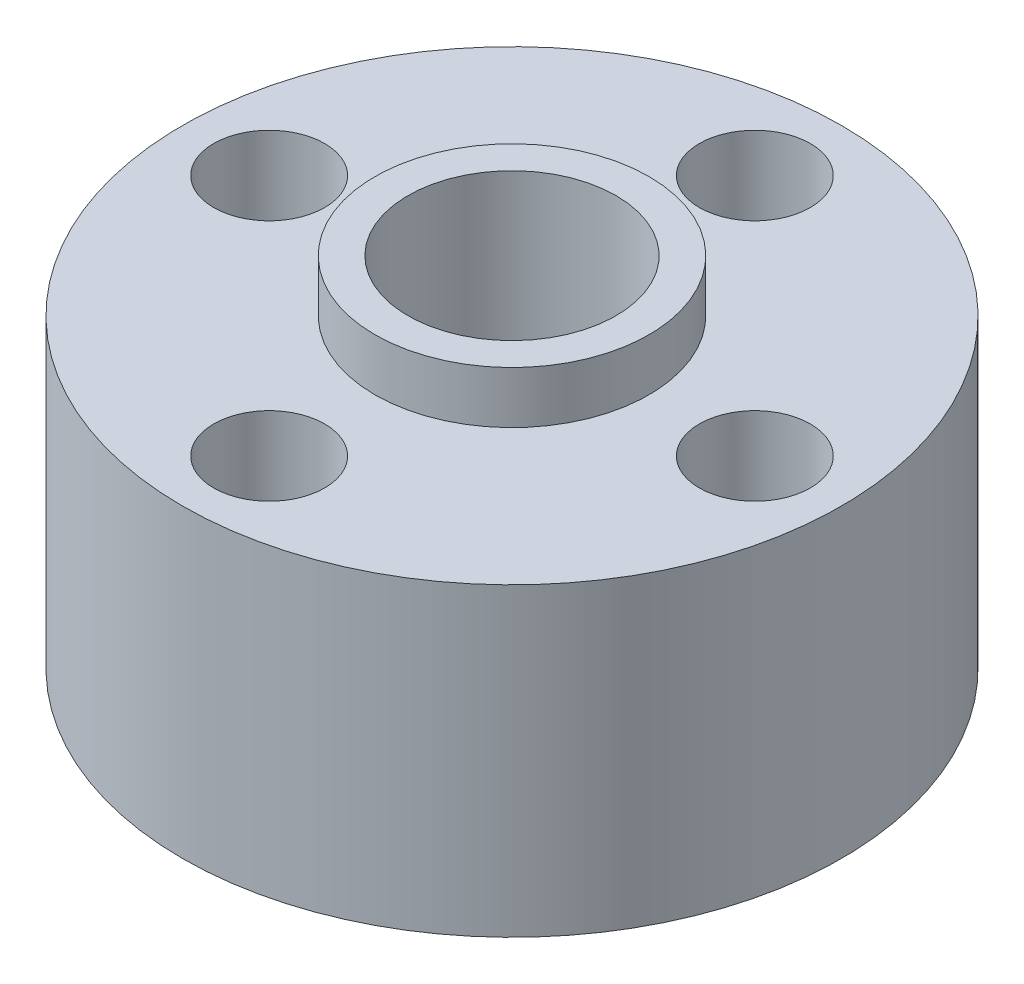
from build123d import *

# Parameters (mm, degrees)
SKETCH_1_W                  = 9.5
SKETCH_1_H                  = 8.8
SKETCH_2_R                  = 3.95
EXTRUDE_1_DEPTH             = 1.5
EXTRUDE_START               = 1.5
SKETCH_3_R                  = 3.95
EXTRUDE_2_DEPTH             = 1.5
HOLE_WIZARD_3_2_3_2_1_D     = 3.2
HOLE_WIZARD_3_2_3_2_1_DEPTH = 10.3
HOLE_WIZARD_6_0_6_1_D       = 6


with BuildPart() as part:
    # Sketch 1 → Revolve 1 (revolve)
    with BuildSketch(Plane(origin=(0, 0, 0), x_dir=(-1, 0, 0), z_dir=(0, 0, -1)), mode=Mode.PRIVATE) as revolve_1_sk:
        with Locations((-4.75, 0.025)):
            Rectangle(SKETCH_1_W, SKETCH_1_H)
    revolve(revolve_1_sk.sketch.rotate(Axis((0, -4.375, 0), (0, 1, 0)), 270), axis=Axis((0, -4.375, 0), (0, 1, 0)))

    # Sketch 2 → Extrude 1 (add)
    with BuildSketch(Plane(origin=(0, 4.425, 0), x_dir=(-1, 0, 0), z_dir=(0, 1, 0))):
        with Locations(Location((0, 0, 0), (0, 0, 90))):
            Circle(SKETCH_2_R)
    extrude(amount=EXTRUDE_1_DEPTH)

    # Sketch 3 → Extrude 2 (add)
    with BuildSketch(Plane.XZ.offset(4.375).offset(EXTRUDE_START)):
        with Locations(Location((0, 0, 0), (0, 0, 90))):
            Circle(SKETCH_3_R)
    extrude(amount=-EXTRUDE_2_DEPTH)

    # Hole Wizard 3.2 _3.2_ _1
    with Locations(Plane(origin=(0, -4.375, 0), x_dir=(-1, 0, 0), z_dir=(0, -1, 0))):
        with Locations((0, 7), (-7, 0), (0, -7), (7, 0)):
            Hole(HOLE_WIZARD_3_2_3_2_1_D / 2, depth=HOLE_WIZARD_3_2_3_2_1_DEPTH)

    # Hole Wizard 6.0 _6_ _1 (through all)
    with Locations(Plane(origin=(0, -5.875, 0), x_dir=(-1, 0, 0), z_dir=(0, -1, 0))):
        with Locations((0, 0)):
            Hole(HOLE_WIZARD_6_0_6_1_D / 2)


solid = part.part
